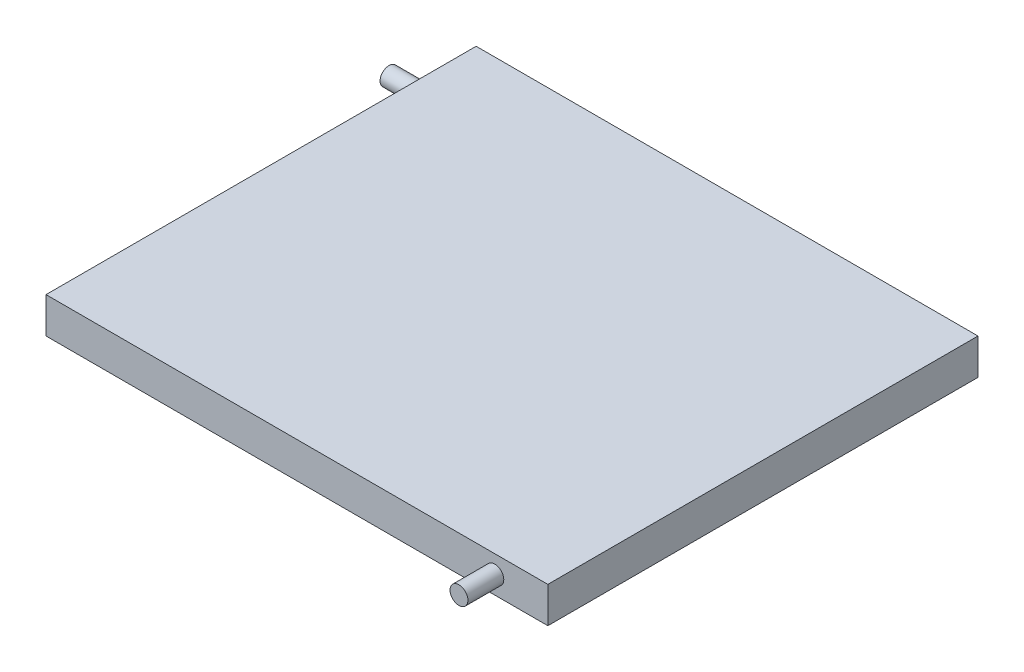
ISO-10303-21;
HEADER;
FILE_DESCRIPTION(('STEP AP214'),'2;1');
FILE_NAME('part.step','',(''),(''),'','','');
FILE_SCHEMA(('AUTOMOTIVE_DESIGN { 1 0 10303 214 1 1 1 1 }'));
ENDSEC;
DATA;
#1=APPLICATION_CONTEXT('core data for automotive mechanical design processes');
#2=APPLICATION_PROTOCOL_DEFINITION('international standard','automotive_design',2000,#1);
#3=PRODUCT_CONTEXT('',#1,'mechanical');
#4=PRODUCT('Part','Part','',(#3));
#5=PRODUCT_RELATED_PRODUCT_CATEGORY('part','',(#4));
#6=PRODUCT_DEFINITION_FORMATION('','',#4);
#7=PRODUCT_DEFINITION_CONTEXT('part definition',#1,'design');
#8=PRODUCT_DEFINITION('design','',#6,#7);
#9=PRODUCT_DEFINITION_SHAPE('','',#8);
#10=(LENGTH_UNIT() NAMED_UNIT(*) SI_UNIT(.MILLI.,.METRE.));
#11=(NAMED_UNIT(*) PLANE_ANGLE_UNIT() SI_UNIT($,.RADIAN.));
#12=(NAMED_UNIT(*) SI_UNIT($,.STERADIAN.) SOLID_ANGLE_UNIT());
#13=UNCERTAINTY_MEASURE_WITH_UNIT(LENGTH_MEASURE(1.E-05),#10,'distance_accuracy_value','');
#14=(GEOMETRIC_REPRESENTATION_CONTEXT(3) GLOBAL_UNCERTAINTY_ASSIGNED_CONTEXT((#13)) GLOBAL_UNIT_ASSIGNED_CONTEXT((#10,
#11,#12)) REPRESENTATION_CONTEXT('',''));
#15=CARTESIAN_POINT('',(0.,0.,0.));
#16=DIRECTION('',(0.,0.,1.));
#17=DIRECTION('',(1.,0.,0.));
#18=AXIS2_PLACEMENT_3D('',#15,#16,#17);
#19=CARTESIAN_POINT('',(171.929052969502,0.,-268.459925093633));
#20=DIRECTION('',(-1.,0.,0.));
#21=DIRECTION('',(0.,0.,1.));
#22=AXIS2_PLACEMENT_3D('',#19,#20,#21);
#23=CYLINDRICAL_SURFACE('',#22,6.35);
#24=CARTESIAN_POINT('',(171.929052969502,0.,-268.459925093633));
#25=DIRECTION('',(1.,0.,0.));
#26=DIRECTION('',(0.,0.,-1.));
#27=AXIS2_PLACEMENT_3D('',#24,#25,#26);
#28=CIRCLE('',#27,6.35);
#29=CARTESIAN_POINT('',(171.929052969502,0.,-274.809925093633));
#30=VERTEX_POINT('',#29);
#31=EDGE_CURVE('E40',#30,#30,#28,.T.);
#32=ORIENTED_EDGE('',*,*,#31,.F.);
#33=EDGE_LOOP('',(#32));
#34=FACE_BOUND('',#33,.T.);
#35=CARTESIAN_POINT('',(-25.4,0.,-268.459925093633));
#36=DIRECTION('',(1.,0.,0.));
#37=DIRECTION('',(0.,0.,-1.));
#38=AXIS2_PLACEMENT_3D('',#35,#36,#37);
#39=CIRCLE('',#38,6.35);
#40=CARTESIAN_POINT('',(-25.4,0.,-274.809925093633));
#41=VERTEX_POINT('',#40);
#42=EDGE_CURVE('E11',#41,#41,#39,.T.);
#43=ORIENTED_EDGE('',*,*,#42,.T.);
#44=EDGE_LOOP('',(#43));
#45=FACE_BOUND('',#44,.T.);
#46=ADVANCED_FACE('F34',(#34,#45),#23,.T.);
#47=CARTESIAN_POINT('',(171.929052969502,0.,-255.759925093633));
#48=DIRECTION('',(0.,1.,0.));
#49=DIRECTION('',(0.,0.,1.));
#50=AXIS2_PLACEMENT_3D('',#47,#48,#49);
#51=TOROIDAL_SURFACE('',#50,12.7000000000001,6.35);
#52=CARTESIAN_POINT('',(171.929052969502,0.,-243.059925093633));
#53=DIRECTION('',(-1.,0.,0.));
#54=DIRECTION('',(0.,0.,1.));
#55=AXIS2_PLACEMENT_3D('',#52,#53,#54);
#56=CIRCLE('',#55,6.35);
#57=CARTESIAN_POINT('',(171.929052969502,0.,-236.709925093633));
#58=VERTEX_POINT('',#57);
#59=EDGE_CURVE('E44',#58,#58,#56,.T.);
#60=CARTESIAN_POINT('',(171.929052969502,0.,-255.759925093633));
#61=DIRECTION('',(0.,1.,0.));
#62=DIRECTION('',(0.,0.,1.));
#63=AXIS2_PLACEMENT_3D('',#60,#61,#62);
#64=CIRCLE('',#63,19.0500000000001);
#65=EDGE_CURVE('',#58,#30,#64,.T.);
#66=ORIENTED_EDGE('',*,*,#59,.F.);
#67=ORIENTED_EDGE('',*,*,#31,.T.);
#68=ORIENTED_EDGE('',*,*,#65,.T.);
#69=ORIENTED_EDGE('',*,*,#65,.F.);
#70=EDGE_LOOP('',(#66,#68,#67,#69));
#71=FACE_BOUND('',#70,.T.);
#72=ADVANCED_FACE('F132',(#71),#51,.T.);
#73=CARTESIAN_POINT('',(42.6083603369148,0.,-243.059925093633));
#74=DIRECTION('',(1.,0.,0.));
#75=DIRECTION('',(0.,0.,-1.));
#76=AXIS2_PLACEMENT_3D('',#73,#74,#75);
#77=CYLINDRICAL_SURFACE('',#76,6.35);
#78=CARTESIAN_POINT('',(42.6083603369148,0.,-243.059925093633));
#79=DIRECTION('',(-1.,0.,0.));
#80=DIRECTION('',(0.,0.,1.));
#81=AXIS2_PLACEMENT_3D('',#78,#79,#80);
#82=CIRCLE('',#81,6.35);
#83=CARTESIAN_POINT('',(42.6083603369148,0.,-249.409925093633));
#84=VERTEX_POINT('',#83);
#85=EDGE_CURVE('E48',#84,#84,#82,.T.);
#86=ORIENTED_EDGE('',*,*,#85,.F.);
#87=EDGE_LOOP('',(#86));
#88=FACE_BOUND('',#87,.T.);
#89=ORIENTED_EDGE('',*,*,#59,.T.);
#90=EDGE_LOOP('',(#89));
#91=FACE_BOUND('',#90,.T.);
#92=ADVANCED_FACE('F137',(#88,#91),#77,.T.);
#93=CARTESIAN_POINT('',(42.6083603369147,0.,-230.359925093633));
#94=DIRECTION('',(0.,-1.,0.));
#95=DIRECTION('',(0.,0.,-1.));
#96=AXIS2_PLACEMENT_3D('',#93,#94,#95);
#97=TOROIDAL_SURFACE('',#96,12.6999999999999,6.35);
#98=CARTESIAN_POINT('',(42.6083603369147,0.,-217.659925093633));
#99=DIRECTION('',(1.,0.,0.));
#100=DIRECTION('',(0.,0.,-1.));
#101=AXIS2_PLACEMENT_3D('',#98,#99,#100);
#102=CIRCLE('',#101,6.35);
#103=CARTESIAN_POINT('',(42.6083603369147,0.,-211.309925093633));
#104=VERTEX_POINT('',#103);
#105=EDGE_CURVE('E53',#104,#104,#102,.T.);
#106=CARTESIAN_POINT('',(42.6083603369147,0.,-230.359925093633));
#107=DIRECTION('',(0.,-1.,0.));
#108=DIRECTION('',(0.,0.,-1.));
#109=AXIS2_PLACEMENT_3D('',#106,#107,#108);
#110=CIRCLE('',#109,19.0499999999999);
#111=EDGE_CURVE('',#104,#84,#110,.T.);
#112=ORIENTED_EDGE('',*,*,#105,.F.);
#113=ORIENTED_EDGE('',*,*,#85,.T.);
#114=ORIENTED_EDGE('',*,*,#111,.T.);
#115=ORIENTED_EDGE('',*,*,#111,.F.);
#116=EDGE_LOOP('',(#112,#114,#113,#115));
#117=FACE_BOUND('',#116,.T.);
#118=ADVANCED_FACE('F142',(#117),#97,.T.);
#119=CARTESIAN_POINT('',(171.929052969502,0.,-217.659925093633));
#120=DIRECTION('',(-1.,0.,0.));
#121=DIRECTION('',(0.,0.,1.));
#122=AXIS2_PLACEMENT_3D('',#119,#120,#121);
#123=CYLINDRICAL_SURFACE('',#122,6.35);
#124=CARTESIAN_POINT('',(171.929052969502,0.,-217.659925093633));
#125=DIRECTION('',(1.,0.,0.));
#126=DIRECTION('',(0.,0.,-1.));
#127=AXIS2_PLACEMENT_3D('',#124,#125,#126);
#128=CIRCLE('',#127,6.35);
#129=CARTESIAN_POINT('',(171.929052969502,0.,-224.009925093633));
#130=VERTEX_POINT('',#129);
#131=EDGE_CURVE('E56',#130,#130,#128,.T.);
#132=ORIENTED_EDGE('',*,*,#131,.F.);
#133=EDGE_LOOP('',(#132));
#134=FACE_BOUND('',#133,.T.);
#135=ORIENTED_EDGE('',*,*,#105,.T.);
#136=EDGE_LOOP('',(#135));
#137=FACE_BOUND('',#136,.T.);
#138=ADVANCED_FACE('F149',(#134,#137),#123,.T.);
#139=CARTESIAN_POINT('',(171.929052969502,0.,-204.959925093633));
#140=DIRECTION('',(0.,1.,0.));
#141=DIRECTION('',(0.,0.,1.));
#142=AXIS2_PLACEMENT_3D('',#139,#140,#141);
#143=TOROIDAL_SURFACE('',#142,12.7000000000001,6.35);
#144=CARTESIAN_POINT('',(171.929052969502,0.,-192.259925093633));
#145=DIRECTION('',(-1.,0.,0.));
#146=DIRECTION('',(0.,0.,1.));
#147=AXIS2_PLACEMENT_3D('',#144,#145,#146);
#148=CIRCLE('',#147,6.35);
#149=CARTESIAN_POINT('',(171.929052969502,0.,-185.909925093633));
#150=VERTEX_POINT('',#149);
#151=EDGE_CURVE('E59',#150,#150,#148,.T.);
#152=CARTESIAN_POINT('',(171.929052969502,0.,-204.959925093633));
#153=DIRECTION('',(0.,1.,0.));
#154=DIRECTION('',(0.,0.,1.));
#155=AXIS2_PLACEMENT_3D('',#152,#153,#154);
#156=CIRCLE('',#155,19.0500000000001);
#157=EDGE_CURVE('',#150,#130,#156,.T.);
#158=ORIENTED_EDGE('',*,*,#151,.F.);
#159=ORIENTED_EDGE('',*,*,#131,.T.);
#160=ORIENTED_EDGE('',*,*,#157,.T.);
#161=ORIENTED_EDGE('',*,*,#157,.F.);
#162=EDGE_LOOP('',(#158,#160,#159,#161));
#163=FACE_BOUND('',#162,.T.);
#164=ADVANCED_FACE('F153',(#163),#143,.T.);
#165=CARTESIAN_POINT('',(42.6083603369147,0.,-192.259925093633));
#166=DIRECTION('',(1.,0.,0.));
#167=DIRECTION('',(0.,0.,-1.));
#168=AXIS2_PLACEMENT_3D('',#165,#166,#167);
#169=CYLINDRICAL_SURFACE('',#168,6.35);
#170=CARTESIAN_POINT('',(42.6083603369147,0.,-192.259925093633));
#171=DIRECTION('',(-1.,0.,0.));
#172=DIRECTION('',(0.,0.,1.));
#173=AXIS2_PLACEMENT_3D('',#170,#171,#172);
#174=CIRCLE('',#173,6.35);
#175=CARTESIAN_POINT('',(42.6083603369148,0.,-198.609925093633));
#176=VERTEX_POINT('',#175);
#177=EDGE_CURVE('E62',#176,#176,#174,.T.);
#178=ORIENTED_EDGE('',*,*,#177,.F.);
#179=EDGE_LOOP('',(#178));
#180=FACE_BOUND('',#179,.T.);
#181=ORIENTED_EDGE('',*,*,#151,.T.);
#182=EDGE_LOOP('',(#181));
#183=FACE_BOUND('',#182,.T.);
#184=ADVANCED_FACE('F157',(#180,#183),#169,.T.);
#185=CARTESIAN_POINT('',(42.6083603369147,0.,-179.559925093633));
#186=DIRECTION('',(0.,-1.,0.));
#187=DIRECTION('',(0.,0.,-1.));
#188=AXIS2_PLACEMENT_3D('',#185,#186,#187);
#189=TOROIDAL_SURFACE('',#188,12.6999999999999,6.35);
#190=CARTESIAN_POINT('',(42.6083603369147,0.,-166.859925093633));
#191=DIRECTION('',(1.,0.,0.));
#192=DIRECTION('',(0.,0.,-1.));
#193=AXIS2_PLACEMENT_3D('',#190,#191,#192);
#194=CIRCLE('',#193,6.35);
#195=CARTESIAN_POINT('',(42.6083603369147,0.,-160.509925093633));
#196=VERTEX_POINT('',#195);
#197=EDGE_CURVE('E65',#196,#196,#194,.T.);
#198=CARTESIAN_POINT('',(42.6083603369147,0.,-179.559925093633));
#199=DIRECTION('',(0.,-1.,0.));
#200=DIRECTION('',(0.,0.,-1.));
#201=AXIS2_PLACEMENT_3D('',#198,#199,#200);
#202=CIRCLE('',#201,19.0499999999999);
#203=EDGE_CURVE('',#196,#176,#202,.T.);
#204=ORIENTED_EDGE('',*,*,#197,.F.);
#205=ORIENTED_EDGE('',*,*,#177,.T.);
#206=ORIENTED_EDGE('',*,*,#203,.T.);
#207=ORIENTED_EDGE('',*,*,#203,.F.);
#208=EDGE_LOOP('',(#204,#206,#205,#207));
#209=FACE_BOUND('',#208,.T.);
#210=ADVANCED_FACE('F161',(#209),#189,.T.);
#211=CARTESIAN_POINT('',(171.929052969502,0.,-166.859925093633));
#212=DIRECTION('',(-1.,0.,0.));
#213=DIRECTION('',(0.,0.,1.));
#214=AXIS2_PLACEMENT_3D('',#211,#212,#213);
#215=CYLINDRICAL_SURFACE('',#214,6.35);
#216=CARTESIAN_POINT('',(171.929052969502,0.,-166.859925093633));
#217=DIRECTION('',(1.,0.,0.));
#218=DIRECTION('',(0.,0.,-1.));
#219=AXIS2_PLACEMENT_3D('',#216,#217,#218);
#220=CIRCLE('',#219,6.35);
#221=CARTESIAN_POINT('',(171.929052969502,0.,-173.209925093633));
#222=VERTEX_POINT('',#221);
#223=EDGE_CURVE('E68',#222,#222,#220,.T.);
#224=ORIENTED_EDGE('',*,*,#223,.F.);
#225=EDGE_LOOP('',(#224));
#226=FACE_BOUND('',#225,.T.);
#227=ORIENTED_EDGE('',*,*,#197,.T.);
#228=EDGE_LOOP('',(#227));
#229=FACE_BOUND('',#228,.T.);
#230=ADVANCED_FACE('F165',(#226,#229),#215,.T.);
#231=CARTESIAN_POINT('',(171.929052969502,0.,-154.159925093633));
#232=DIRECTION('',(0.,1.,0.));
#233=DIRECTION('',(0.,0.,1.));
#234=AXIS2_PLACEMENT_3D('',#231,#232,#233);
#235=TOROIDAL_SURFACE('',#234,12.7000000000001,6.35);
#236=CARTESIAN_POINT('',(171.929052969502,0.,-141.459925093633));
#237=DIRECTION('',(-1.,0.,0.));
#238=DIRECTION('',(0.,0.,1.));
#239=AXIS2_PLACEMENT_3D('',#236,#237,#238);
#240=CIRCLE('',#239,6.35);
#241=CARTESIAN_POINT('',(171.929052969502,0.,-135.109925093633));
#242=VERTEX_POINT('',#241);
#243=EDGE_CURVE('E71',#242,#242,#240,.T.);
#244=CARTESIAN_POINT('',(171.929052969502,0.,-154.159925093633));
#245=DIRECTION('',(0.,1.,0.));
#246=DIRECTION('',(0.,0.,1.));
#247=AXIS2_PLACEMENT_3D('',#244,#245,#246);
#248=CIRCLE('',#247,19.0500000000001);
#249=EDGE_CURVE('',#242,#222,#248,.T.);
#250=ORIENTED_EDGE('',*,*,#243,.F.);
#251=ORIENTED_EDGE('',*,*,#223,.T.);
#252=ORIENTED_EDGE('',*,*,#249,.T.);
#253=ORIENTED_EDGE('',*,*,#249,.F.);
#254=EDGE_LOOP('',(#250,#252,#251,#253));
#255=FACE_BOUND('',#254,.T.);
#256=ADVANCED_FACE('F169',(#255),#235,.T.);
#257=CARTESIAN_POINT('',(42.6083603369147,0.,-141.459925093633));
#258=DIRECTION('',(1.,0.,0.));
#259=DIRECTION('',(0.,0.,-1.));
#260=AXIS2_PLACEMENT_3D('',#257,#258,#259);
#261=CYLINDRICAL_SURFACE('',#260,6.35);
#262=CARTESIAN_POINT('',(42.6083603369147,0.,-141.459925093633));
#263=DIRECTION('',(-1.,0.,0.));
#264=DIRECTION('',(0.,0.,1.));
#265=AXIS2_PLACEMENT_3D('',#262,#263,#264);
#266=CIRCLE('',#265,6.35);
#267=CARTESIAN_POINT('',(42.6083603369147,0.,-147.809925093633));
#268=VERTEX_POINT('',#267);
#269=EDGE_CURVE('E74',#268,#268,#266,.T.);
#270=ORIENTED_EDGE('',*,*,#269,.F.);
#271=EDGE_LOOP('',(#270));
#272=FACE_BOUND('',#271,.T.);
#273=ORIENTED_EDGE('',*,*,#243,.T.);
#274=EDGE_LOOP('',(#273));
#275=FACE_BOUND('',#274,.T.);
#276=ADVANCED_FACE('F173',(#272,#275),#261,.T.);
#277=CARTESIAN_POINT('',(42.6083603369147,0.,-128.759925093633));
#278=DIRECTION('',(0.,-1.,0.));
#279=DIRECTION('',(0.,0.,-1.));
#280=AXIS2_PLACEMENT_3D('',#277,#278,#279);
#281=TOROIDAL_SURFACE('',#280,12.6999999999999,6.35);
#282=CARTESIAN_POINT('',(42.6083603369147,0.,-116.059925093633));
#283=DIRECTION('',(1.,0.,0.));
#284=DIRECTION('',(0.,0.,-1.));
#285=AXIS2_PLACEMENT_3D('',#282,#283,#284);
#286=CIRCLE('',#285,6.35);
#287=CARTESIAN_POINT('',(42.6083603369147,0.,-109.709925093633));
#288=VERTEX_POINT('',#287);
#289=EDGE_CURVE('E77',#288,#288,#286,.T.);
#290=CARTESIAN_POINT('',(42.6083603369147,0.,-128.759925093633));
#291=DIRECTION('',(0.,-1.,0.));
#292=DIRECTION('',(0.,0.,-1.));
#293=AXIS2_PLACEMENT_3D('',#290,#291,#292);
#294=CIRCLE('',#293,19.0499999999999);
#295=EDGE_CURVE('',#288,#268,#294,.T.);
#296=ORIENTED_EDGE('',*,*,#289,.F.);
#297=ORIENTED_EDGE('',*,*,#269,.T.);
#298=ORIENTED_EDGE('',*,*,#295,.T.);
#299=ORIENTED_EDGE('',*,*,#295,.F.);
#300=EDGE_LOOP('',(#296,#298,#297,#299));
#301=FACE_BOUND('',#300,.T.);
#302=ADVANCED_FACE('F177',(#301),#281,.T.);
#303=CARTESIAN_POINT('',(203.728657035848,0.,-116.059925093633));
#304=DIRECTION('',(-1.,0.,0.));
#305=DIRECTION('',(0.,0.,1.));
#306=AXIS2_PLACEMENT_3D('',#303,#304,#305);
#307=CYLINDRICAL_SURFACE('',#306,6.35);
#308=CARTESIAN_POINT('',(203.728657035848,0.,-116.059925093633));
#309=DIRECTION('',(1.,0.,0.));
#310=DIRECTION('',(0.,0.,-1.));
#311=AXIS2_PLACEMENT_3D('',#308,#309,#310);
#312=CIRCLE('',#311,6.35);
#313=CARTESIAN_POINT('',(203.728657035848,0.,-122.409925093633));
#314=VERTEX_POINT('',#313);
#315=EDGE_CURVE('E80',#314,#314,#312,.T.);
#316=ORIENTED_EDGE('',*,*,#315,.F.);
#317=EDGE_LOOP('',(#316));
#318=FACE_BOUND('',#317,.T.);
#319=ORIENTED_EDGE('',*,*,#289,.T.);
#320=EDGE_LOOP('',(#319));
#321=FACE_BOUND('',#320,.T.);
#322=ADVANCED_FACE('F181',(#318,#321),#307,.T.);
#323=CARTESIAN_POINT('',(203.728657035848,0.,-103.359925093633));
#324=DIRECTION('',(0.,1.,0.));
#325=DIRECTION('',(0.,0.,1.));
#326=AXIS2_PLACEMENT_3D('',#323,#324,#325);
#327=TOROIDAL_SURFACE('',#326,12.7,6.35);
#328=CARTESIAN_POINT('',(216.428657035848,0.,-103.359925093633));
#329=DIRECTION('',(0.,0.,1.));
#330=DIRECTION('',(1.,0.,0.));
#331=AXIS2_PLACEMENT_3D('',#328,#329,#330);
#332=CIRCLE('',#331,6.35);
#333=CARTESIAN_POINT('',(222.778657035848,0.,-103.359925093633));
#334=VERTEX_POINT('',#333);
#335=EDGE_CURVE('E83',#334,#334,#332,.T.);
#336=CARTESIAN_POINT('',(203.728657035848,0.,-103.359925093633));
#337=DIRECTION('',(0.,1.,0.));
#338=DIRECTION('',(0.,0.,1.));
#339=AXIS2_PLACEMENT_3D('',#336,#337,#338);
#340=CIRCLE('',#339,19.05);
#341=EDGE_CURVE('',#334,#314,#340,.T.);
#342=ORIENTED_EDGE('',*,*,#335,.F.);
#343=ORIENTED_EDGE('',*,*,#315,.T.);
#344=ORIENTED_EDGE('',*,*,#341,.T.);
#345=ORIENTED_EDGE('',*,*,#341,.F.);
#346=EDGE_LOOP('',(#342,#344,#343,#345));
#347=FACE_BOUND('',#346,.T.);
#348=ADVANCED_FACE('F185',(#347),#327,.T.);
#349=CARTESIAN_POINT('',(216.428657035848,0.,-33.5065275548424));
#350=DIRECTION('',(0.,0.,-1.));
#351=DIRECTION('',(-1.,0.,0.));
#352=AXIS2_PLACEMENT_3D('',#349,#350,#351);
#353=CYLINDRICAL_SURFACE('',#352,6.35);
#354=CARTESIAN_POINT('',(216.428657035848,0.,-33.5065275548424));
#355=DIRECTION('',(0.,0.,1.));
#356=DIRECTION('',(1.,0.,0.));
#357=AXIS2_PLACEMENT_3D('',#354,#355,#356);
#358=CIRCLE('',#357,6.35);
#359=CARTESIAN_POINT('',(210.078657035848,0.,-33.5065275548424));
#360=VERTEX_POINT('',#359);
#361=EDGE_CURVE('E86',#360,#360,#358,.T.);
#362=ORIENTED_EDGE('',*,*,#361,.F.);
#363=EDGE_LOOP('',(#362));
#364=FACE_BOUND('',#363,.T.);
#365=ORIENTED_EDGE('',*,*,#335,.T.);
#366=EDGE_LOOP('',(#365));
#367=FACE_BOUND('',#366,.T.);
#368=ADVANCED_FACE('F189',(#364,#367),#353,.T.);
#369=CARTESIAN_POINT('',(229.128657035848,0.,-33.5065275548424));
#370=DIRECTION('',(0.,-1.,0.));
#371=DIRECTION('',(0.,0.,-1.));
#372=AXIS2_PLACEMENT_3D('',#369,#370,#371);
#373=TOROIDAL_SURFACE('',#372,12.7,6.35);
#374=CARTESIAN_POINT('',(241.828657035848,0.,-33.5065275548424));
#375=DIRECTION('',(0.,0.,-1.));
#376=DIRECTION('',(-1.,0.,0.));
#377=AXIS2_PLACEMENT_3D('',#374,#375,#376);
#378=CIRCLE('',#377,6.35);
#379=CARTESIAN_POINT('',(248.178657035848,0.,-33.5065275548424));
#380=VERTEX_POINT('',#379);
#381=EDGE_CURVE('E89',#380,#380,#378,.T.);
#382=CARTESIAN_POINT('',(229.128657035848,0.,-33.5065275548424));
#383=DIRECTION('',(0.,-1.,0.));
#384=DIRECTION('',(0.,0.,-1.));
#385=AXIS2_PLACEMENT_3D('',#382,#383,#384);
#386=CIRCLE('',#385,19.05);
#387=EDGE_CURVE('',#380,#360,#386,.T.);
#388=ORIENTED_EDGE('',*,*,#381,.F.);
#389=ORIENTED_EDGE('',*,*,#361,.T.);
#390=ORIENTED_EDGE('',*,*,#387,.T.);
#391=ORIENTED_EDGE('',*,*,#387,.F.);
#392=EDGE_LOOP('',(#388,#390,#389,#391));
#393=FACE_BOUND('',#392,.T.);
#394=ADVANCED_FACE('F193',(#393),#373,.T.);
#395=CARTESIAN_POINT('',(241.828657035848,0.,-103.359925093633));
#396=DIRECTION('',(0.,0.,1.));
#397=DIRECTION('',(1.,0.,0.));
#398=AXIS2_PLACEMENT_3D('',#395,#396,#397);
#399=CYLINDRICAL_SURFACE('',#398,6.35);
#400=CARTESIAN_POINT('',(241.828657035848,0.,-103.359925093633));
#401=DIRECTION('',(0.,0.,-1.));
#402=DIRECTION('',(-1.,0.,0.));
#403=AXIS2_PLACEMENT_3D('',#400,#401,#402);
#404=CIRCLE('',#403,6.35);
#405=CARTESIAN_POINT('',(235.478657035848,0.,-103.359925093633));
#406=VERTEX_POINT('',#405);
#407=EDGE_CURVE('E92',#406,#406,#404,.T.);
#408=ORIENTED_EDGE('',*,*,#407,.F.);
#409=EDGE_LOOP('',(#408));
#410=FACE_BOUND('',#409,.T.);
#411=ORIENTED_EDGE('',*,*,#381,.T.);
#412=EDGE_LOOP('',(#411));
#413=FACE_BOUND('',#412,.T.);
#414=ADVANCED_FACE('F197',(#410,#413),#399,.T.);
#415=CARTESIAN_POINT('',(254.528657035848,0.,-103.359925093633));
#416=DIRECTION('',(0.,1.,0.));
#417=DIRECTION('',(0.,0.,1.));
#418=AXIS2_PLACEMENT_3D('',#415,#416,#417);
#419=TOROIDAL_SURFACE('',#418,12.7,6.35);
#420=CARTESIAN_POINT('',(267.228657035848,0.,-103.359925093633));
#421=DIRECTION('',(0.,0.,1.));
#422=DIRECTION('',(1.,0.,0.));
#423=AXIS2_PLACEMENT_3D('',#420,#421,#422);
#424=CIRCLE('',#423,6.35);
#425=CARTESIAN_POINT('',(273.578657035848,0.,-103.359925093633));
#426=VERTEX_POINT('',#425);
#427=EDGE_CURVE('E95',#426,#426,#424,.T.);
#428=CARTESIAN_POINT('',(254.528657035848,0.,-103.359925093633));
#429=DIRECTION('',(0.,1.,0.));
#430=DIRECTION('',(0.,0.,1.));
#431=AXIS2_PLACEMENT_3D('',#428,#429,#430);
#432=CIRCLE('',#431,19.05);
#433=EDGE_CURVE('',#426,#406,#432,.T.);
#434=ORIENTED_EDGE('',*,*,#427,.F.);
#435=ORIENTED_EDGE('',*,*,#407,.T.);
#436=ORIENTED_EDGE('',*,*,#433,.T.);
#437=ORIENTED_EDGE('',*,*,#433,.F.);
#438=EDGE_LOOP('',(#434,#436,#435,#437));
#439=FACE_BOUND('',#438,.T.);
#440=ADVANCED_FACE('F201',(#439),#419,.T.);
#441=CARTESIAN_POINT('',(267.228657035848,0.,-33.5065275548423));
#442=DIRECTION('',(0.,0.,-1.));
#443=DIRECTION('',(-1.,0.,0.));
#444=AXIS2_PLACEMENT_3D('',#441,#442,#443);
#445=CYLINDRICAL_SURFACE('',#444,6.35);
#446=CARTESIAN_POINT('',(267.228657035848,0.,-33.5065275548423));
#447=DIRECTION('',(0.,0.,1.));
#448=DIRECTION('',(1.,0.,0.));
#449=AXIS2_PLACEMENT_3D('',#446,#447,#448);
#450=CIRCLE('',#449,6.35);
#451=CARTESIAN_POINT('',(260.878657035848,0.,-33.5065275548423));
#452=VERTEX_POINT('',#451);
#453=EDGE_CURVE('E98',#452,#452,#450,.T.);
#454=ORIENTED_EDGE('',*,*,#453,.F.);
#455=EDGE_LOOP('',(#454));
#456=FACE_BOUND('',#455,.T.);
#457=ORIENTED_EDGE('',*,*,#427,.T.);
#458=EDGE_LOOP('',(#457));
#459=FACE_BOUND('',#458,.T.);
#460=ADVANCED_FACE('F205',(#456,#459),#445,.T.);
#461=CARTESIAN_POINT('',(279.928657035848,0.,-33.5065275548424));
#462=DIRECTION('',(0.,-1.,0.));
#463=DIRECTION('',(0.,0.,-1.));
#464=AXIS2_PLACEMENT_3D('',#461,#462,#463);
#465=TOROIDAL_SURFACE('',#464,12.6999999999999,6.35);
#466=CARTESIAN_POINT('',(292.628657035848,0.,-33.5065275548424));
#467=DIRECTION('',(0.,0.,-1.));
#468=DIRECTION('',(-1.,0.,0.));
#469=AXIS2_PLACEMENT_3D('',#466,#467,#468);
#470=CIRCLE('',#469,6.35);
#471=CARTESIAN_POINT('',(298.978657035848,0.,-33.5065275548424));
#472=VERTEX_POINT('',#471);
#473=EDGE_CURVE('E101',#472,#472,#470,.T.);
#474=CARTESIAN_POINT('',(279.928657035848,0.,-33.5065275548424));
#475=DIRECTION('',(0.,-1.,0.));
#476=DIRECTION('',(0.,0.,-1.));
#477=AXIS2_PLACEMENT_3D('',#474,#475,#476);
#478=CIRCLE('',#477,19.0499999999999);
#479=EDGE_CURVE('',#472,#452,#478,.T.);
#480=ORIENTED_EDGE('',*,*,#473,.F.);
#481=ORIENTED_EDGE('',*,*,#453,.T.);
#482=ORIENTED_EDGE('',*,*,#479,.T.);
#483=ORIENTED_EDGE('',*,*,#479,.F.);
#484=EDGE_LOOP('',(#480,#482,#481,#483));
#485=FACE_BOUND('',#484,.T.);
#486=ADVANCED_FACE('F209',(#485),#465,.T.);
#487=CARTESIAN_POINT('',(292.628657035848,0.,-103.359925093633));
#488=DIRECTION('',(0.,0.,1.));
#489=DIRECTION('',(1.,0.,0.));
#490=AXIS2_PLACEMENT_3D('',#487,#488,#489);
#491=CYLINDRICAL_SURFACE('',#490,6.35);
#492=CARTESIAN_POINT('',(292.628657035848,0.,-103.359925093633));
#493=DIRECTION('',(0.,0.,-1.));
#494=DIRECTION('',(-1.,0.,0.));
#495=AXIS2_PLACEMENT_3D('',#492,#493,#494);
#496=CIRCLE('',#495,6.35);
#497=CARTESIAN_POINT('',(286.278657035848,0.,-103.359925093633));
#498=VERTEX_POINT('',#497);
#499=EDGE_CURVE('E104',#498,#498,#496,.T.);
#500=ORIENTED_EDGE('',*,*,#499,.F.);
#501=EDGE_LOOP('',(#500));
#502=FACE_BOUND('',#501,.T.);
#503=ORIENTED_EDGE('',*,*,#473,.T.);
#504=EDGE_LOOP('',(#503));
#505=FACE_BOUND('',#504,.T.);
#506=ADVANCED_FACE('F128',(#502,#505),#491,.T.);
#507=CARTESIAN_POINT('',(305.328657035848,0.,-103.359925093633));
#508=DIRECTION('',(0.,1.,0.));
#509=DIRECTION('',(0.,0.,1.));
#510=AXIS2_PLACEMENT_3D('',#507,#508,#509);
#511=TOROIDAL_SURFACE('',#510,12.7,6.35);
#512=CARTESIAN_POINT('',(318.028657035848,0.,-103.359925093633));
#513=DIRECTION('',(0.,0.,1.));
#514=DIRECTION('',(1.,0.,0.));
#515=AXIS2_PLACEMENT_3D('',#512,#513,#514);
#516=CIRCLE('',#515,6.35);
#517=CARTESIAN_POINT('',(324.378657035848,0.,-103.359925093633));
#518=VERTEX_POINT('',#517);
#519=EDGE_CURVE('E107',#518,#518,#516,.T.);
#520=CARTESIAN_POINT('',(305.328657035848,0.,-103.359925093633));
#521=DIRECTION('',(0.,1.,0.));
#522=DIRECTION('',(0.,0.,1.));
#523=AXIS2_PLACEMENT_3D('',#520,#521,#522);
#524=CIRCLE('',#523,19.05);
#525=EDGE_CURVE('',#518,#498,#524,.T.);
#526=ORIENTED_EDGE('',*,*,#519,.F.);
#527=ORIENTED_EDGE('',*,*,#499,.T.);
#528=ORIENTED_EDGE('',*,*,#525,.T.);
#529=ORIENTED_EDGE('',*,*,#525,.F.);
#530=EDGE_LOOP('',(#526,#528,#527,#529));
#531=FACE_BOUND('',#530,.T.);
#532=ADVANCED_FACE('F119',(#531),#511,.T.);
#533=CARTESIAN_POINT('',(318.028657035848,0.,-103.359925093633));
#534=DIRECTION('',(0.,0.,1.));
#535=DIRECTION('',(1.,0.,0.));
#536=AXIS2_PLACEMENT_3D('',#533,#534,#535);
#537=CYLINDRICAL_SURFACE('',#536,6.35);
#538=ORIENTED_EDGE('',*,*,#519,.T.);
#539=EDGE_LOOP('',(#538));
#540=FACE_BOUND('',#539,.T.);
#541=CARTESIAN_POINT('',(318.028657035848,0.,25.4));
#542=DIRECTION('',(0.,0.,1.));
#543=DIRECTION('',(1.,0.,0.));
#544=AXIS2_PLACEMENT_3D('',#541,#542,#543);
#545=CIRCLE('',#544,6.35);
#546=CARTESIAN_POINT('',(324.378657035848,0.,25.4));
#547=VERTEX_POINT('',#546);
#548=EDGE_CURVE('E110',#547,#547,#545,.T.);
#549=ORIENTED_EDGE('',*,*,#548,.F.);
#550=EDGE_LOOP('',(#549));
#551=FACE_BOUND('',#550,.T.);
#552=ADVANCED_FACE('F116',(#540,#551),#537,.T.);
#553=CARTESIAN_POINT('',(-25.4,0.,-268.459925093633));
#554=DIRECTION('',(1.,0.,0.));
#555=DIRECTION('',(0.,0.,-1.));
#556=AXIS2_PLACEMENT_3D('',#553,#554,#555);
#557=PLANE('',#556);
#558=ORIENTED_EDGE('',*,*,#42,.F.);
#559=EDGE_LOOP('',(#558));
#560=FACE_BOUND('',#559,.T.);
#561=ADVANCED_FACE('F118',(#560),#557,.F.);
#562=CARTESIAN_POINT('',(318.028657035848,0.,25.4));
#563=DIRECTION('',(0.,0.,1.));
#564=DIRECTION('',(1.,0.,0.));
#565=AXIS2_PLACEMENT_3D('',#562,#563,#564);
#566=PLANE('',#565);
#567=ORIENTED_EDGE('',*,*,#548,.T.);
#568=EDGE_LOOP('',(#567));
#569=FACE_BOUND('',#568,.T.);
#570=ADVANCED_FACE('F114',(#569),#566,.T.);
#571=CLOSED_SHELL('',(#46,#72,#92,#118,#138,#164,#184,#210,#230,#256,#276,#302,#322,#348,#368,
#394,#414,#440,#460,#486,#506,#532,#552,#561,#570));
#572=MANIFOLD_SOLID_BREP('B2',#571);
#573=CARTESIAN_POINT('',(0.,-12.7,0.));
#574=DIRECTION('',(-1.,0.,0.));
#575=DIRECTION('',(0.,0.,1.));
#576=AXIS2_PLACEMENT_3D('',#573,#574,#575);
#577=PLANE('',#576);
#578=DIRECTION('',(0.,0.,1.));
#579=VECTOR('',#578,1.);
#580=CARTESIAN_POINT('',(0.,12.7,0.));
#581=LINE('',#580,#579);
#582=CARTESIAN_POINT('',(0.,12.7,-304.8));
#583=VERTEX_POINT('',#582);
#584=CARTESIAN_POINT('',(0.,12.7,0.));
#585=VERTEX_POINT('',#584);
#586=EDGE_CURVE('E394',#583,#585,#581,.T.);
#587=ORIENTED_EDGE('',*,*,#586,.F.);
#588=DIRECTION('',(0.,1.,0.));
#589=VECTOR('',#588,1.);
#590=CARTESIAN_POINT('',(0.,-12.7,-304.8));
#591=LINE('',#590,#589);
#592=CARTESIAN_POINT('',(0.,-12.7,-304.8));
#593=VERTEX_POINT('',#592);
#594=EDGE_CURVE('E32',#593,#583,#591,.T.);
#595=ORIENTED_EDGE('',*,*,#594,.F.);
#596=DIRECTION('',(0.,0.,1.));
#597=VECTOR('',#596,1.);
#598=CARTESIAN_POINT('',(0.,-12.7,0.));
#599=LINE('',#598,#597);
#600=CARTESIAN_POINT('',(0.,-12.7,0.));
#601=VERTEX_POINT('',#600);
#602=EDGE_CURVE('E396',#593,#601,#599,.T.);
#603=ORIENTED_EDGE('',*,*,#602,.T.);
#604=DIRECTION('',(0.,1.,0.));
#605=VECTOR('',#604,1.);
#606=CARTESIAN_POINT('',(0.,-12.7,0.));
#607=LINE('',#606,#605);
#608=EDGE_CURVE('E357',#601,#585,#607,.T.);
#609=ORIENTED_EDGE('',*,*,#608,.T.);
#610=EDGE_LOOP('',(#587,#595,#603,#609));
#611=FACE_BOUND('',#610,.T.);
#612=ADVANCED_FACE('F354',(#611),#577,.T.);
#613=CARTESIAN_POINT('',(0.,-12.7,-304.8));
#614=DIRECTION('',(0.,0.,-1.));
#615=DIRECTION('',(-1.,0.,0.));
#616=AXIS2_PLACEMENT_3D('',#613,#614,#615);
#617=PLANE('',#616);
#618=DIRECTION('',(-1.,0.,0.));
#619=VECTOR('',#618,1.);
#620=CARTESIAN_POINT('',(0.,12.7,-304.8));
#621=LINE('',#620,#619);
#622=CARTESIAN_POINT('',(355.6,12.7,-304.8));
#623=VERTEX_POINT('',#622);
#624=EDGE_CURVE('E411',#623,#583,#621,.T.);
#625=ORIENTED_EDGE('',*,*,#624,.F.);
#626=DIRECTION('',(0.,1.,0.));
#627=VECTOR('',#626,1.);
#628=CARTESIAN_POINT('',(355.6,-12.7,-304.8));
#629=LINE('',#628,#627);
#630=CARTESIAN_POINT('',(355.6,-12.7,-304.8));
#631=VERTEX_POINT('',#630);
#632=EDGE_CURVE('E362',#631,#623,#629,.T.);
#633=ORIENTED_EDGE('',*,*,#632,.F.);
#634=DIRECTION('',(-1.,0.,0.));
#635=VECTOR('',#634,1.);
#636=CARTESIAN_POINT('',(0.,-12.7,-304.8));
#637=LINE('',#636,#635);
#638=EDGE_CURVE('E401',#631,#593,#637,.T.);
#639=ORIENTED_EDGE('',*,*,#638,.T.);
#640=ORIENTED_EDGE('',*,*,#594,.T.);
#641=EDGE_LOOP('',(#625,#633,#639,#640));
#642=FACE_BOUND('',#641,.T.);
#643=ADVANCED_FACE('F426',(#642),#617,.T.);
#644=CARTESIAN_POINT('',(355.6,-12.7,0.));
#645=DIRECTION('',(1.,0.,0.));
#646=DIRECTION('',(0.,0.,-1.));
#647=AXIS2_PLACEMENT_3D('',#644,#645,#646);
#648=PLANE('',#647);
#649=DIRECTION('',(0.,0.,-1.));
#650=VECTOR('',#649,1.);
#651=CARTESIAN_POINT('',(355.6,12.7,0.));
#652=LINE('',#651,#650);
#653=CARTESIAN_POINT('',(355.6,12.7,0.));
#654=VERTEX_POINT('',#653);
#655=EDGE_CURVE('E408',#654,#623,#652,.T.);
#656=ORIENTED_EDGE('',*,*,#655,.F.);
#657=DIRECTION('',(0.,1.,0.));
#658=VECTOR('',#657,1.);
#659=CARTESIAN_POINT('',(355.6,-12.7,0.));
#660=LINE('',#659,#658);
#661=CARTESIAN_POINT('',(355.6,-12.7,0.));
#662=VERTEX_POINT('',#661);
#663=EDGE_CURVE('E400',#662,#654,#660,.T.);
#664=ORIENTED_EDGE('',*,*,#663,.F.);
#665=DIRECTION('',(0.,0.,-1.));
#666=VECTOR('',#665,1.);
#667=CARTESIAN_POINT('',(355.6,-12.7,0.));
#668=LINE('',#667,#666);
#669=EDGE_CURVE('E419',#662,#631,#668,.T.);
#670=ORIENTED_EDGE('',*,*,#669,.T.);
#671=ORIENTED_EDGE('',*,*,#632,.T.);
#672=EDGE_LOOP('',(#656,#664,#670,#671));
#673=FACE_BOUND('',#672,.T.);
#674=ADVANCED_FACE('F423',(#673),#648,.T.);
#675=CARTESIAN_POINT('',(0.,-12.7,0.));
#676=DIRECTION('',(0.,0.,1.));
#677=DIRECTION('',(1.,0.,0.));
#678=AXIS2_PLACEMENT_3D('',#675,#676,#677);
#679=PLANE('',#678);
#680=DIRECTION('',(1.,0.,0.));
#681=VECTOR('',#680,1.);
#682=CARTESIAN_POINT('',(0.,12.7,0.));
#683=LINE('',#682,#681);
#684=EDGE_CURVE('E403',#585,#654,#683,.T.);
#685=ORIENTED_EDGE('',*,*,#684,.F.);
#686=ORIENTED_EDGE('',*,*,#608,.F.);
#687=DIRECTION('',(1.,0.,0.));
#688=VECTOR('',#687,1.);
#689=CARTESIAN_POINT('',(0.,-12.7,0.));
#690=LINE('',#689,#688);
#691=EDGE_CURVE('E417',#601,#662,#690,.T.);
#692=ORIENTED_EDGE('',*,*,#691,.T.);
#693=ORIENTED_EDGE('',*,*,#663,.T.);
#694=EDGE_LOOP('',(#685,#686,#692,#693));
#695=FACE_BOUND('',#694,.T.);
#696=ADVANCED_FACE('F404',(#695),#679,.T.);
#697=CARTESIAN_POINT('',(0.,-12.7,-304.8));
#698=DIRECTION('',(0.,-1.,0.));
#699=DIRECTION('',(0.,0.,-1.));
#700=AXIS2_PLACEMENT_3D('',#697,#698,#699);
#701=PLANE('',#700);
#702=ORIENTED_EDGE('',*,*,#602,.F.);
#703=ORIENTED_EDGE('',*,*,#638,.F.);
#704=ORIENTED_EDGE('',*,*,#669,.F.);
#705=ORIENTED_EDGE('',*,*,#691,.F.);
#706=EDGE_LOOP('',(#702,#703,#704,#705));
#707=FACE_BOUND('',#706,.T.);
#708=ADVANCED_FACE('F428',(#707),#701,.T.);
#709=CARTESIAN_POINT('',(0.,12.7,-304.8));
#710=DIRECTION('',(0.,-1.,0.));
#711=DIRECTION('',(0.,0.,-1.));
#712=AXIS2_PLACEMENT_3D('',#709,#710,#711);
#713=PLANE('',#712);
#714=ORIENTED_EDGE('',*,*,#586,.T.);
#715=ORIENTED_EDGE('',*,*,#684,.T.);
#716=ORIENTED_EDGE('',*,*,#655,.T.);
#717=ORIENTED_EDGE('',*,*,#624,.T.);
#718=EDGE_LOOP('',(#714,#715,#716,#717));
#719=FACE_BOUND('',#718,.T.);
#720=ADVANCED_FACE('F410',(#719),#713,.F.);
#721=CLOSED_SHELL('',(#612,#643,#674,#696,#708,#720));
#722=MANIFOLD_SOLID_BREP('B6',#721);
#723=ADVANCED_BREP_SHAPE_REPRESENTATION('',(#18,#572,#722),#14);
#724=SHAPE_DEFINITION_REPRESENTATION(#9,#723);
ENDSEC;
END-ISO-10303-21;
